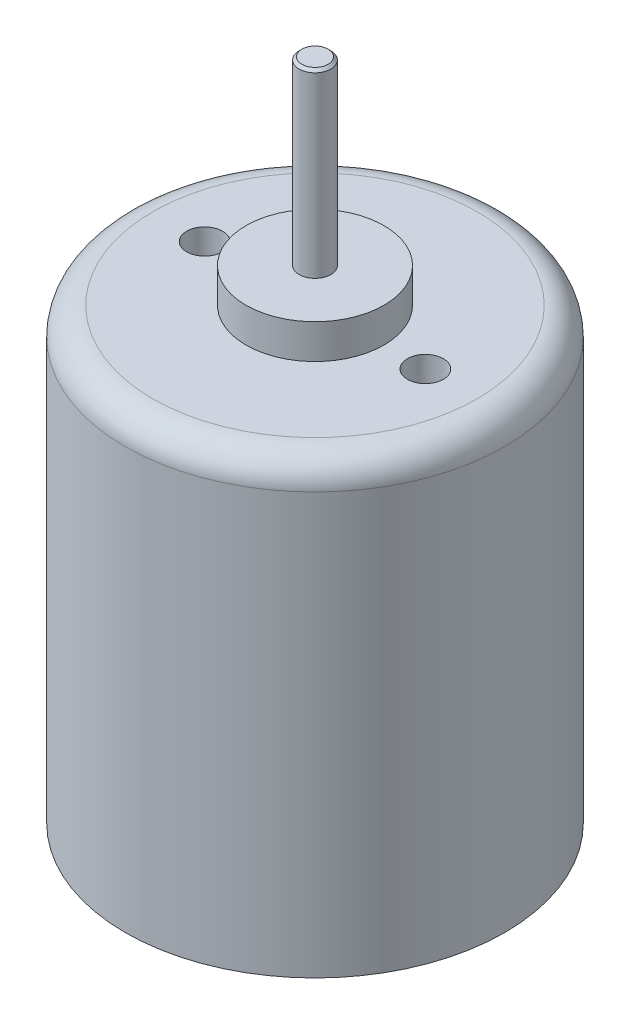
ISO-10303-21;
HEADER;
FILE_DESCRIPTION(('STEP AP214'),'2;1');
FILE_NAME('part.step','',(''),(''),'','','');
FILE_SCHEMA(('AUTOMOTIVE_DESIGN { 1 0 10303 214 1 1 1 1 }'));
ENDSEC;
DATA;
#1=APPLICATION_CONTEXT('core data for automotive mechanical design processes');
#2=APPLICATION_PROTOCOL_DEFINITION('international standard','automotive_design',2000,#1);
#3=PRODUCT_CONTEXT('',#1,'mechanical');
#4=PRODUCT('Part','Part','',(#3));
#5=PRODUCT_RELATED_PRODUCT_CATEGORY('part','',(#4));
#6=PRODUCT_DEFINITION_FORMATION('','',#4);
#7=PRODUCT_DEFINITION_CONTEXT('part definition',#1,'design');
#8=PRODUCT_DEFINITION('design','',#6,#7);
#9=PRODUCT_DEFINITION_SHAPE('','',#8);
#10=(LENGTH_UNIT() NAMED_UNIT(*) SI_UNIT(.MILLI.,.METRE.));
#11=(NAMED_UNIT(*) PLANE_ANGLE_UNIT() SI_UNIT($,.RADIAN.));
#12=(NAMED_UNIT(*) SI_UNIT($,.STERADIAN.) SOLID_ANGLE_UNIT());
#13=UNCERTAINTY_MEASURE_WITH_UNIT(LENGTH_MEASURE(1.E-05),#10,'distance_accuracy_value','');
#14=(GEOMETRIC_REPRESENTATION_CONTEXT(3) GLOBAL_UNCERTAINTY_ASSIGNED_CONTEXT((#13)) GLOBAL_UNIT_ASSIGNED_CONTEXT((#10,
#11,#12)) REPRESENTATION_CONTEXT('',''));
#15=CARTESIAN_POINT('',(0.,0.,0.));
#16=DIRECTION('',(0.,0.,1.));
#17=DIRECTION('',(1.,0.,0.));
#18=AXIS2_PLACEMENT_3D('',#15,#16,#17);
#19=CARTESIAN_POINT('',(0.,35.,0.));
#20=DIRECTION('',(0.,-1.,0.));
#21=DIRECTION('',(0.,0.,-1.));
#22=AXIS2_PLACEMENT_3D('',#19,#20,#21);
#23=CYLINDRICAL_SURFACE('',#22,5.);
#24=CARTESIAN_POINT('',(0.,35.,0.));
#25=DIRECTION('',(0.,1.,0.));
#26=DIRECTION('',(0.,0.,1.));
#27=AXIS2_PLACEMENT_3D('',#24,#25,#26);
#28=CIRCLE('',#27,5.);
#29=CARTESIAN_POINT('',(0.,35.,5.));
#30=VERTEX_POINT('',#29);
#31=EDGE_CURVE('E11',#30,#30,#28,.T.);
#32=ORIENTED_EDGE('',*,*,#31,.F.);
#33=EDGE_LOOP('',(#32));
#34=FACE_BOUND('',#33,.T.);
#35=CARTESIAN_POINT('',(0.,32.5,0.));
#36=DIRECTION('',(0.,1.,0.));
#37=DIRECTION('',(0.,0.,1.));
#38=AXIS2_PLACEMENT_3D('',#35,#36,#37);
#39=CIRCLE('',#38,5.);
#40=CARTESIAN_POINT('',(0.,32.5,5.));
#41=VERTEX_POINT('',#40);
#42=EDGE_CURVE('E42',#41,#41,#39,.T.);
#43=ORIENTED_EDGE('',*,*,#42,.T.);
#44=EDGE_LOOP('',(#43));
#45=FACE_BOUND('',#44,.T.);
#46=ADVANCED_FACE('F39',(#34,#45),#23,.T.);
#47=CARTESIAN_POINT('',(0.,35.,0.));
#48=DIRECTION('',(0.,1.,0.));
#49=DIRECTION('',(0.,0.,1.));
#50=AXIS2_PLACEMENT_3D('',#47,#48,#49);
#51=PLANE('',#50);
#52=ORIENTED_EDGE('',*,*,#31,.T.);
#53=EDGE_LOOP('',(#52));
#54=FACE_BOUND('',#53,.T.);
#55=ADVANCED_FACE('F54',(#54),#51,.T.);
#56=CARTESIAN_POINT('',(0.,32.5,0.));
#57=DIRECTION('',(0.,1.,0.));
#58=DIRECTION('',(0.,0.,1.));
#59=AXIS2_PLACEMENT_3D('',#56,#57,#58);
#60=PLANE('',#59);
#61=ORIENTED_EDGE('',*,*,#42,.F.);
#62=EDGE_LOOP('',(#61));
#63=FACE_BOUND('',#62,.T.);
#64=ADVANCED_FACE('F52',(#63),#60,.F.);
#65=CLOSED_SHELL('',(#46,#55,#64));
#66=MANIFOLD_SOLID_BREP('B2',#65);
#67=CARTESIAN_POINT('',(0.,-2.5,0.));
#68=DIRECTION('',(0.,1.,0.));
#69=DIRECTION('',(0.,0.,1.));
#70=AXIS2_PLACEMENT_3D('',#67,#68,#69);
#71=CYLINDRICAL_SURFACE('',#70,5.);
#72=CARTESIAN_POINT('',(0.,-2.5,0.));
#73=DIRECTION('',(0.,-1.,0.));
#74=DIRECTION('',(0.,0.,-1.));
#75=AXIS2_PLACEMENT_3D('',#72,#73,#74);
#76=CIRCLE('',#75,5.);
#77=CARTESIAN_POINT('',(0.,-2.5,-5.));
#78=VERTEX_POINT('',#77);
#79=EDGE_CURVE('E38',#78,#78,#76,.T.);
#80=ORIENTED_EDGE('',*,*,#79,.F.);
#81=EDGE_LOOP('',(#80));
#82=FACE_BOUND('',#81,.T.);
#83=CARTESIAN_POINT('',(0.,0.,0.));
#84=DIRECTION('',(0.,-1.,0.));
#85=DIRECTION('',(0.,0.,-1.));
#86=AXIS2_PLACEMENT_3D('',#83,#84,#85);
#87=CIRCLE('',#86,5.);
#88=CARTESIAN_POINT('',(0.,0.,-5.));
#89=VERTEX_POINT('',#88);
#90=EDGE_CURVE('E90',#89,#89,#87,.T.);
#91=ORIENTED_EDGE('',*,*,#90,.T.);
#92=EDGE_LOOP('',(#91));
#93=FACE_BOUND('',#92,.T.);
#94=ADVANCED_FACE('F87',(#82,#93),#71,.T.);
#95=CARTESIAN_POINT('',(0.,-2.5,0.));
#96=DIRECTION('',(0.,-1.,0.));
#97=DIRECTION('',(0.,0.,-1.));
#98=AXIS2_PLACEMENT_3D('',#95,#96,#97);
#99=PLANE('',#98);
#100=ORIENTED_EDGE('',*,*,#79,.T.);
#101=EDGE_LOOP('',(#100));
#102=FACE_BOUND('',#101,.T.);
#103=ADVANCED_FACE('F102',(#102),#99,.T.);
#104=CARTESIAN_POINT('',(0.,0.,0.));
#105=DIRECTION('',(0.,-1.,0.));
#106=DIRECTION('',(0.,0.,-1.));
#107=AXIS2_PLACEMENT_3D('',#104,#105,#106);
#108=PLANE('',#107);
#109=ORIENTED_EDGE('',*,*,#90,.F.);
#110=EDGE_LOOP('',(#109));
#111=FACE_BOUND('',#110,.T.);
#112=ADVANCED_FACE('F100',(#111),#108,.F.);
#113=CLOSED_SHELL('',(#94,#103,#112));
#114=MANIFOLD_SOLID_BREP('B6',#113);
#115=CARTESIAN_POINT('',(0.,-2.89999999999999,0.));
#116=DIRECTION('',(0.,1.,0.));
#117=DIRECTION('',(0.,0.,1.));
#118=AXIS2_PLACEMENT_3D('',#115,#116,#117);
#119=CYLINDRICAL_SURFACE('',#118,1.15);
#120=CARTESIAN_POINT('',(0.,-2.69999999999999,0.));
#121=DIRECTION('',(0.,1.,0.));
#122=DIRECTION('',(0.,0.,1.));
#123=AXIS2_PLACEMENT_3D('',#120,#121,#122);
#124=CIRCLE('',#123,1.15);
#125=CARTESIAN_POINT('',(0.,-2.69999999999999,1.15));
#126=VERTEX_POINT('',#125);
#127=EDGE_CURVE('E145',#126,#126,#124,.T.);
#128=ORIENTED_EDGE('',*,*,#127,.T.);
#129=EDGE_LOOP('',(#128));
#130=FACE_BOUND('',#129,.T.);
#131=CARTESIAN_POINT('',(0.,47.9,0.));
#132=DIRECTION('',(0.,1.,0.));
#133=DIRECTION('',(0.,0.,1.));
#134=AXIS2_PLACEMENT_3D('',#131,#132,#133);
#135=CIRCLE('',#134,1.15);
#136=CARTESIAN_POINT('',(0.,47.9,1.15));
#137=VERTEX_POINT('',#136);
#138=EDGE_CURVE('E149',#137,#137,#135,.F.);
#139=ORIENTED_EDGE('',*,*,#138,.T.);
#140=EDGE_LOOP('',(#139));
#141=FACE_BOUND('',#140,.T.);
#142=ADVANCED_FACE('F134',(#130,#141),#119,.T.);
#143=CARTESIAN_POINT('',(0.,-2.89999999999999,0.));
#144=DIRECTION('',(0.,1.,0.));
#145=DIRECTION('',(0.,0.,1.));
#146=AXIS2_PLACEMENT_3D('',#143,#144,#145);
#147=PLANE('',#146);
#148=CARTESIAN_POINT('',(0.,-2.89999999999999,0.));
#149=DIRECTION('',(0.,1.,0.));
#150=DIRECTION('',(0.,0.,1.));
#151=AXIS2_PLACEMENT_3D('',#148,#149,#150);
#152=CIRCLE('',#151,0.95);
#153=CARTESIAN_POINT('',(0.,-2.89999999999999,0.95));
#154=VERTEX_POINT('',#153);
#155=EDGE_CURVE('E141',#154,#154,#152,.F.);
#156=ORIENTED_EDGE('',*,*,#155,.T.);
#157=EDGE_LOOP('',(#156));
#158=FACE_BOUND('',#157,.T.);
#159=ADVANCED_FACE('F165',(#158),#147,.F.);
#160=CARTESIAN_POINT('',(0.,48.1,0.));
#161=DIRECTION('',(0.,1.,0.));
#162=DIRECTION('',(0.,0.,1.));
#163=AXIS2_PLACEMENT_3D('',#160,#161,#162);
#164=PLANE('',#163);
#165=CARTESIAN_POINT('',(0.,48.1,0.));
#166=DIRECTION('',(0.,1.,0.));
#167=DIRECTION('',(0.,0.,1.));
#168=AXIS2_PLACEMENT_3D('',#165,#166,#167);
#169=CIRCLE('',#168,0.950000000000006);
#170=CARTESIAN_POINT('',(0.,48.1,0.950000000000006));
#171=VERTEX_POINT('',#170);
#172=EDGE_CURVE('E86',#171,#171,#169,.T.);
#173=ORIENTED_EDGE('',*,*,#172,.T.);
#174=EDGE_LOOP('',(#173));
#175=FACE_BOUND('',#174,.T.);
#176=ADVANCED_FACE('F162',(#175),#164,.T.);
#177=CARTESIAN_POINT('',(0.,-2.69999999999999,0.));
#178=DIRECTION('',(0.,1.,0.));
#179=DIRECTION('',(0.,0.,1.));
#180=AXIS2_PLACEMENT_3D('',#177,#178,#179);
#181=CONICAL_SURFACE('',#180,1.15,0.785398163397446);
#182=ORIENTED_EDGE('',*,*,#155,.F.);
#183=EDGE_LOOP('',(#182));
#184=FACE_BOUND('',#183,.T.);
#185=ORIENTED_EDGE('',*,*,#127,.F.);
#186=EDGE_LOOP('',(#185));
#187=FACE_BOUND('',#186,.T.);
#188=ADVANCED_FACE('F158',(#184,#187),#181,.T.);
#189=CARTESIAN_POINT('',(0.,48.1,0.));
#190=DIRECTION('',(0.,-1.,0.));
#191=DIRECTION('',(0.,0.,-1.));
#192=AXIS2_PLACEMENT_3D('',#189,#190,#191);
#193=CONICAL_SURFACE('',#192,0.950000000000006,0.785398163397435);
#194=ORIENTED_EDGE('',*,*,#138,.F.);
#195=EDGE_LOOP('',(#194));
#196=FACE_BOUND('',#195,.T.);
#197=ORIENTED_EDGE('',*,*,#172,.F.);
#198=EDGE_LOOP('',(#197));
#199=FACE_BOUND('',#198,.T.);
#200=ADVANCED_FACE('F136',(#196,#199),#193,.T.);
#201=CLOSED_SHELL('',(#142,#159,#176,#188,#200));
#202=MANIFOLD_SOLID_BREP('B33',#201);
#203=CARTESIAN_POINT('',(0.,32.5,0.));
#204=DIRECTION('',(0.,-1.,0.));
#205=DIRECTION('',(0.,0.,-1.));
#206=AXIS2_PLACEMENT_3D('',#203,#204,#205);
#207=CYLINDRICAL_SURFACE('',#206,13.75);
#208=CARTESIAN_POINT('',(0.,30.5,0.));
#209=DIRECTION('',(0.,1.,0.));
#210=DIRECTION('',(0.,0.,1.));
#211=AXIS2_PLACEMENT_3D('',#208,#209,#210);
#212=CIRCLE('',#211,13.75);
#213=CARTESIAN_POINT('',(0.,30.5,13.75));
#214=VERTEX_POINT('',#213);
#215=EDGE_CURVE('E133',#214,#214,#212,.F.);
#216=ORIENTED_EDGE('',*,*,#215,.T.);
#217=EDGE_LOOP('',(#216));
#218=FACE_BOUND('',#217,.T.);
#219=CARTESIAN_POINT('',(0.,0.,0.));
#220=DIRECTION('',(0.,1.,0.));
#221=DIRECTION('',(0.,0.,1.));
#222=AXIS2_PLACEMENT_3D('',#219,#220,#221);
#223=CIRCLE('',#222,13.75);
#224=CARTESIAN_POINT('',(0.,0.,13.75));
#225=VERTEX_POINT('',#224);
#226=EDGE_CURVE('E215',#225,#225,#223,.T.);
#227=ORIENTED_EDGE('',*,*,#226,.T.);
#228=EDGE_LOOP('',(#227));
#229=FACE_BOUND('',#228,.T.);
#230=ADVANCED_FACE('F204',(#218,#229),#207,.T.);
#231=CARTESIAN_POINT('',(0.,32.5,0.));
#232=DIRECTION('',(0.,1.,0.));
#233=DIRECTION('',(0.,0.,1.));
#234=AXIS2_PLACEMENT_3D('',#231,#232,#233);
#235=PLANE('',#234);
#236=CARTESIAN_POINT('',(0.,32.5,0.));
#237=DIRECTION('',(0.,1.,0.));
#238=DIRECTION('',(0.,0.,1.));
#239=AXIS2_PLACEMENT_3D('',#236,#237,#238);
#240=CIRCLE('',#239,11.75);
#241=CARTESIAN_POINT('',(0.,32.5,11.75));
#242=VERTEX_POINT('',#241);
#243=EDGE_CURVE('E211',#242,#242,#240,.T.);
#244=ORIENTED_EDGE('',*,*,#243,.T.);
#245=EDGE_LOOP('',(#244));
#246=FACE_BOUND('',#245,.T.);
#247=CARTESIAN_POINT('',(8.,32.5,0.));
#248=DIRECTION('',(0.,1.,0.));
#249=DIRECTION('',(0.,0.,-1.));
#250=AXIS2_PLACEMENT_3D('',#247,#248,#249);
#251=CIRCLE('',#250,1.3);
#252=CARTESIAN_POINT('',(8.,32.5,-1.3));
#253=VERTEX_POINT('',#252);
#254=EDGE_CURVE('E228',#253,#253,#251,.T.);
#255=ORIENTED_EDGE('',*,*,#254,.F.);
#256=EDGE_LOOP('',(#255));
#257=FACE_BOUND('',#256,.T.);
#258=CARTESIAN_POINT('',(-8.,32.5,0.));
#259=DIRECTION('',(0.,1.,0.));
#260=DIRECTION('',(0.,0.,1.));
#261=AXIS2_PLACEMENT_3D('',#258,#259,#260);
#262=CIRCLE('',#261,1.3);
#263=CARTESIAN_POINT('',(-8.,32.5,1.3));
#264=VERTEX_POINT('',#263);
#265=EDGE_CURVE('E222',#264,#264,#262,.T.);
#266=ORIENTED_EDGE('',*,*,#265,.F.);
#267=EDGE_LOOP('',(#266));
#268=FACE_BOUND('',#267,.T.);
#269=ADVANCED_FACE('F243',(#246,#257,#268),#235,.T.);
#270=CARTESIAN_POINT('',(0.,0.,0.));
#271=DIRECTION('',(0.,1.,0.));
#272=DIRECTION('',(0.,0.,1.));
#273=AXIS2_PLACEMENT_3D('',#270,#271,#272);
#274=PLANE('',#273);
#275=ORIENTED_EDGE('',*,*,#226,.F.);
#276=EDGE_LOOP('',(#275));
#277=FACE_BOUND('',#276,.T.);
#278=ADVANCED_FACE('F246',(#277),#274,.F.);
#279=CARTESIAN_POINT('',(-8.,27.5,0.));
#280=DIRECTION('',(0.,1.,0.));
#281=DIRECTION('',(0.,0.,1.));
#282=AXIS2_PLACEMENT_3D('',#279,#280,#281);
#283=CYLINDRICAL_SURFACE('',#282,1.3);
#284=CARTESIAN_POINT('',(-8.,27.5,0.));
#285=DIRECTION('',(0.,1.,0.));
#286=DIRECTION('',(0.,0.,1.));
#287=AXIS2_PLACEMENT_3D('',#284,#285,#286);
#288=CIRCLE('',#287,1.3);
#289=CARTESIAN_POINT('',(-8.,27.5,1.3));
#290=VERTEX_POINT('',#289);
#291=EDGE_CURVE('E219',#290,#290,#288,.T.);
#292=ORIENTED_EDGE('',*,*,#291,.F.);
#293=EDGE_LOOP('',(#292));
#294=FACE_BOUND('',#293,.T.);
#295=ORIENTED_EDGE('',*,*,#265,.T.);
#296=EDGE_LOOP('',(#295));
#297=FACE_BOUND('',#296,.T.);
#298=ADVANCED_FACE('F250',(#294,#297),#283,.F.);
#299=CARTESIAN_POINT('',(-8.,27.5,0.));
#300=DIRECTION('',(0.,1.,0.));
#301=DIRECTION('',(0.,0.,1.));
#302=AXIS2_PLACEMENT_3D('',#299,#300,#301);
#303=PLANE('',#302);
#304=ORIENTED_EDGE('',*,*,#291,.T.);
#305=EDGE_LOOP('',(#304));
#306=FACE_BOUND('',#305,.T.);
#307=ADVANCED_FACE('F239',(#306),#303,.T.);
#308=CARTESIAN_POINT('',(8.,27.5,0.));
#309=DIRECTION('',(0.,1.,0.));
#310=DIRECTION('',(0.,0.,1.));
#311=AXIS2_PLACEMENT_3D('',#308,#309,#310);
#312=CYLINDRICAL_SURFACE('',#311,1.3);
#313=CARTESIAN_POINT('',(8.,27.5,0.));
#314=DIRECTION('',(0.,1.,0.));
#315=DIRECTION('',(0.,0.,-1.));
#316=AXIS2_PLACEMENT_3D('',#313,#314,#315);
#317=CIRCLE('',#316,1.3);
#318=CARTESIAN_POINT('',(8.,27.5,-1.3));
#319=VERTEX_POINT('',#318);
#320=EDGE_CURVE('E225',#319,#319,#317,.T.);
#321=ORIENTED_EDGE('',*,*,#320,.F.);
#322=EDGE_LOOP('',(#321));
#323=FACE_BOUND('',#322,.T.);
#324=ORIENTED_EDGE('',*,*,#254,.T.);
#325=EDGE_LOOP('',(#324));
#326=FACE_BOUND('',#325,.T.);
#327=ADVANCED_FACE('F236',(#323,#326),#312,.F.);
#328=CARTESIAN_POINT('',(8.,27.5,0.));
#329=DIRECTION('',(0.,-1.,0.));
#330=DIRECTION('',(0.,0.,-1.));
#331=AXIS2_PLACEMENT_3D('',#328,#329,#330);
#332=PLANE('',#331);
#333=ORIENTED_EDGE('',*,*,#320,.T.);
#334=EDGE_LOOP('',(#333));
#335=FACE_BOUND('',#334,.T.);
#336=ADVANCED_FACE('F234',(#335),#332,.F.);
#337=CARTESIAN_POINT('',(0.,30.5,0.));
#338=DIRECTION('',(0.,1.,0.));
#339=DIRECTION('',(0.,0.,1.));
#340=AXIS2_PLACEMENT_3D('',#337,#338,#339);
#341=TOROIDAL_SURFACE('',#340,11.75,2.);
#342=ORIENTED_EDGE('',*,*,#215,.F.);
#343=EDGE_LOOP('',(#342));
#344=FACE_BOUND('',#343,.T.);
#345=ORIENTED_EDGE('',*,*,#243,.F.);
#346=EDGE_LOOP('',(#345));
#347=FACE_BOUND('',#346,.T.);
#348=ADVANCED_FACE('F206',(#344,#347),#341,.T.);
#349=CLOSED_SHELL('',(#230,#269,#278,#298,#307,#327,#336,#348));
#350=MANIFOLD_SOLID_BREP('B81',#349);
#351=ADVANCED_BREP_SHAPE_REPRESENTATION('',(#18,#66,#114,#202,#350),#14);
#352=SHAPE_DEFINITION_REPRESENTATION(#9,#351);
ENDSEC;
END-ISO-10303-21;
